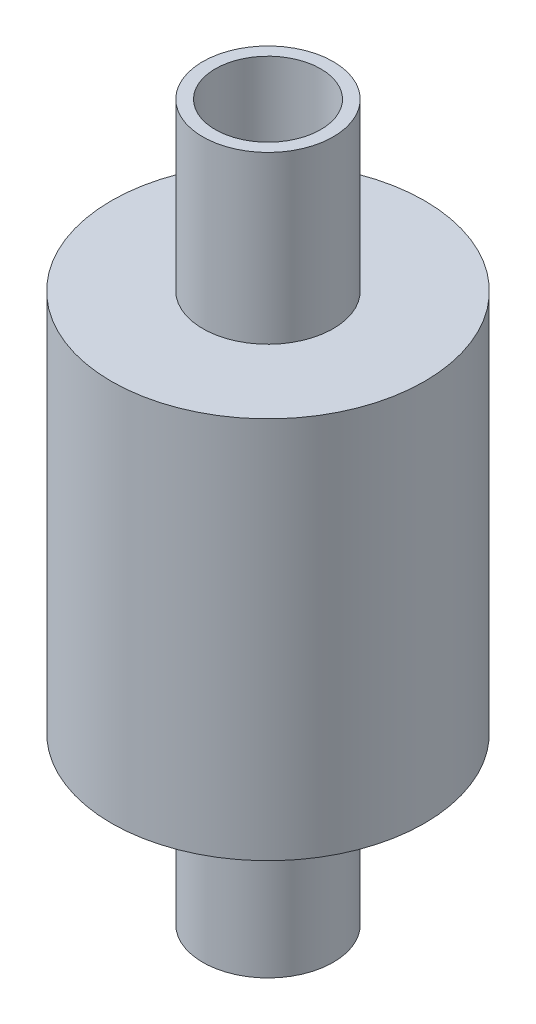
ISO-10303-21;
HEADER;
FILE_DESCRIPTION(('STEP AP214'),'2;1');
FILE_NAME('part.step','',(''),(''),'','','');
FILE_SCHEMA(('AUTOMOTIVE_DESIGN { 1 0 10303 214 1 1 1 1 }'));
ENDSEC;
DATA;
#1=APPLICATION_CONTEXT('core data for automotive mechanical design processes');
#2=APPLICATION_PROTOCOL_DEFINITION('international standard','automotive_design',2000,#1);
#3=PRODUCT_CONTEXT('',#1,'mechanical');
#4=PRODUCT('Part','Part','',(#3));
#5=PRODUCT_RELATED_PRODUCT_CATEGORY('part','',(#4));
#6=PRODUCT_DEFINITION_FORMATION('','',#4);
#7=PRODUCT_DEFINITION_CONTEXT('part definition',#1,'design');
#8=PRODUCT_DEFINITION('design','',#6,#7);
#9=PRODUCT_DEFINITION_SHAPE('','',#8);
#10=(LENGTH_UNIT() NAMED_UNIT(*) SI_UNIT(.MILLI.,.METRE.));
#11=(NAMED_UNIT(*) PLANE_ANGLE_UNIT() SI_UNIT($,.RADIAN.));
#12=(NAMED_UNIT(*) SI_UNIT($,.STERADIAN.) SOLID_ANGLE_UNIT());
#13=UNCERTAINTY_MEASURE_WITH_UNIT(LENGTH_MEASURE(1.E-05),#10,'distance_accuracy_value','');
#14=(GEOMETRIC_REPRESENTATION_CONTEXT(3) GLOBAL_UNCERTAINTY_ASSIGNED_CONTEXT((#13)) GLOBAL_UNIT_ASSIGNED_CONTEXT((#10,
#11,#12)) REPRESENTATION_CONTEXT('',''));
#15=CARTESIAN_POINT('',(0.,0.,0.));
#16=DIRECTION('',(0.,0.,1.));
#17=DIRECTION('',(1.,0.,0.));
#18=AXIS2_PLACEMENT_3D('',#15,#16,#17);
#19=CARTESIAN_POINT('',(-4.7625,0.,0.));
#20=DIRECTION('',(0.,1.,0.));
#21=DIRECTION('',(0.,0.,1.));
#22=AXIS2_PLACEMENT_3D('',#19,#20,#21);
#23=PLANE('',#22);
#24=CARTESIAN_POINT('',(0.,0.,0.));
#25=DIRECTION('',(0.,-1.,0.));
#26=DIRECTION('',(0.,0.,-1.));
#27=AXIS2_PLACEMENT_3D('',#24,#25,#26);
#28=CIRCLE('',#27,3.8481);
#29=CARTESIAN_POINT('',(0.,0.,-3.8481));
#30=VERTEX_POINT('',#29);
#31=EDGE_CURVE('E10',#30,#30,#28,.T.);
#32=ORIENTED_EDGE('',*,*,#31,.F.);
#33=EDGE_LOOP('',(#32));
#34=FACE_BOUND('',#33,.T.);
#35=CARTESIAN_POINT('',(0.,0.,0.));
#36=DIRECTION('',(0.,-1.,0.));
#37=DIRECTION('',(0.,0.,-1.));
#38=AXIS2_PLACEMENT_3D('',#35,#36,#37);
#39=CIRCLE('',#38,4.7625);
#40=CARTESIAN_POINT('',(0.,0.,-4.7625));
#41=VERTEX_POINT('',#40);
#42=EDGE_CURVE('E60',#41,#41,#39,.T.);
#43=ORIENTED_EDGE('',*,*,#42,.T.);
#44=EDGE_LOOP('',(#43));
#45=FACE_BOUND('',#44,.T.);
#46=ADVANCED_FACE('F32',(#34,#45),#23,.F.);
#47=CARTESIAN_POINT('',(0.,0.,0.));
#48=DIRECTION('',(0.,-1.,0.));
#49=DIRECTION('',(0.,0.,-1.));
#50=AXIS2_PLACEMENT_3D('',#47,#48,#49);
#51=CYLINDRICAL_SURFACE('',#50,3.8481);
#52=CARTESIAN_POINT('',(0.,52.197,0.));
#53=DIRECTION('',(0.,-1.,0.));
#54=DIRECTION('',(0.,0.,-1.));
#55=AXIS2_PLACEMENT_3D('',#52,#53,#54);
#56=CIRCLE('',#55,3.8481);
#57=CARTESIAN_POINT('',(0.,52.197,-3.8481));
#58=VERTEX_POINT('',#57);
#59=EDGE_CURVE('E38',#58,#58,#56,.T.);
#60=ORIENTED_EDGE('',*,*,#59,.F.);
#61=EDGE_LOOP('',(#60));
#62=FACE_BOUND('',#61,.T.);
#63=ORIENTED_EDGE('',*,*,#31,.T.);
#64=EDGE_LOOP('',(#63));
#65=FACE_BOUND('',#64,.T.);
#66=ADVANCED_FACE('F97',(#62,#65),#51,.F.);
#67=CARTESIAN_POINT('',(-3.84809999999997,52.197,0.));
#68=DIRECTION('',(0.,-1.,0.));
#69=DIRECTION('',(0.,0.,-1.));
#70=AXIS2_PLACEMENT_3D('',#67,#68,#69);
#71=PLANE('',#70);
#72=CARTESIAN_POINT('',(0.,52.197,0.));
#73=DIRECTION('',(0.,-1.,0.));
#74=DIRECTION('',(0.,0.,-1.));
#75=AXIS2_PLACEMENT_3D('',#72,#73,#74);
#76=CIRCLE('',#75,4.7625);
#77=CARTESIAN_POINT('',(0.,52.197,-4.7625));
#78=VERTEX_POINT('',#77);
#79=EDGE_CURVE('E42',#78,#78,#76,.T.);
#80=ORIENTED_EDGE('',*,*,#79,.F.);
#81=EDGE_LOOP('',(#80));
#82=FACE_BOUND('',#81,.T.);
#83=ORIENTED_EDGE('',*,*,#59,.T.);
#84=EDGE_LOOP('',(#83));
#85=FACE_BOUND('',#84,.T.);
#86=ADVANCED_FACE('F92',(#82,#85),#71,.F.);
#87=CARTESIAN_POINT('',(0.,0.,0.));
#88=DIRECTION('',(0.,-1.,0.));
#89=DIRECTION('',(0.,0.,-1.));
#90=AXIS2_PLACEMENT_3D('',#87,#88,#89);
#91=CYLINDRICAL_SURFACE('',#90,4.7625);
#92=CARTESIAN_POINT('',(0.,40.0685,0.));
#93=DIRECTION('',(0.,-1.,0.));
#94=DIRECTION('',(0.,0.,-1.));
#95=AXIS2_PLACEMENT_3D('',#92,#93,#94);
#96=CIRCLE('',#95,4.7625);
#97=CARTESIAN_POINT('',(0.,40.0685,-4.7625));
#98=VERTEX_POINT('',#97);
#99=EDGE_CURVE('E46',#98,#98,#96,.T.);
#100=ORIENTED_EDGE('',*,*,#99,.F.);
#101=EDGE_LOOP('',(#100));
#102=FACE_BOUND('',#101,.T.);
#103=ORIENTED_EDGE('',*,*,#79,.T.);
#104=EDGE_LOOP('',(#103));
#105=FACE_BOUND('',#104,.T.);
#106=ADVANCED_FACE('F86',(#102,#105),#91,.T.);
#107=CARTESIAN_POINT('',(-4.7625,40.0685,0.));
#108=DIRECTION('',(0.,-1.,0.));
#109=DIRECTION('',(0.,0.,-1.));
#110=AXIS2_PLACEMENT_3D('',#107,#108,#109);
#111=PLANE('',#110);
#112=CARTESIAN_POINT('',(0.,40.0685,0.));
#113=DIRECTION('',(0.,-1.,0.));
#114=DIRECTION('',(0.,0.,-1.));
#115=AXIS2_PLACEMENT_3D('',#112,#113,#114);
#116=CIRCLE('',#115,11.43);
#117=CARTESIAN_POINT('',(0.,40.0685,-11.43));
#118=VERTEX_POINT('',#117);
#119=EDGE_CURVE('E51',#118,#118,#116,.T.);
#120=ORIENTED_EDGE('',*,*,#119,.F.);
#121=EDGE_LOOP('',(#120));
#122=FACE_BOUND('',#121,.T.);
#123=ORIENTED_EDGE('',*,*,#99,.T.);
#124=EDGE_LOOP('',(#123));
#125=FACE_BOUND('',#124,.T.);
#126=ADVANCED_FACE('F80',(#122,#125),#111,.F.);
#127=CARTESIAN_POINT('',(0.,0.,0.));
#128=DIRECTION('',(0.,-1.,0.));
#129=DIRECTION('',(0.,0.,-1.));
#130=AXIS2_PLACEMENT_3D('',#127,#128,#129);
#131=CYLINDRICAL_SURFACE('',#130,11.43);
#132=CARTESIAN_POINT('',(0.,12.1285,0.));
#133=DIRECTION('',(0.,-1.,0.));
#134=DIRECTION('',(0.,0.,-1.));
#135=AXIS2_PLACEMENT_3D('',#132,#133,#134);
#136=CIRCLE('',#135,11.43);
#137=CARTESIAN_POINT('',(0.,12.1285,-11.43));
#138=VERTEX_POINT('',#137);
#139=EDGE_CURVE('E54',#138,#138,#136,.T.);
#140=ORIENTED_EDGE('',*,*,#139,.F.);
#141=EDGE_LOOP('',(#140));
#142=FACE_BOUND('',#141,.T.);
#143=ORIENTED_EDGE('',*,*,#119,.T.);
#144=EDGE_LOOP('',(#143));
#145=FACE_BOUND('',#144,.T.);
#146=ADVANCED_FACE('F74',(#142,#145),#131,.T.);
#147=CARTESIAN_POINT('',(-11.43,12.1285,0.));
#148=DIRECTION('',(0.,1.,0.));
#149=DIRECTION('',(0.,0.,1.));
#150=AXIS2_PLACEMENT_3D('',#147,#148,#149);
#151=PLANE('',#150);
#152=CARTESIAN_POINT('',(0.,12.1285,0.));
#153=DIRECTION('',(0.,-1.,0.));
#154=DIRECTION('',(0.,0.,-1.));
#155=AXIS2_PLACEMENT_3D('',#152,#153,#154);
#156=CIRCLE('',#155,4.7625);
#157=CARTESIAN_POINT('',(0.,12.1285,-4.7625));
#158=VERTEX_POINT('',#157);
#159=EDGE_CURVE('E57',#158,#158,#156,.T.);
#160=ORIENTED_EDGE('',*,*,#159,.F.);
#161=EDGE_LOOP('',(#160));
#162=FACE_BOUND('',#161,.T.);
#163=ORIENTED_EDGE('',*,*,#139,.T.);
#164=EDGE_LOOP('',(#163));
#165=FACE_BOUND('',#164,.T.);
#166=ADVANCED_FACE('F68',(#162,#165),#151,.F.);
#167=CARTESIAN_POINT('',(0.,0.,0.));
#168=DIRECTION('',(0.,-1.,0.));
#169=DIRECTION('',(0.,0.,-1.));
#170=AXIS2_PLACEMENT_3D('',#167,#168,#169);
#171=CYLINDRICAL_SURFACE('',#170,4.7625);
#172=ORIENTED_EDGE('',*,*,#42,.F.);
#173=EDGE_LOOP('',(#172));
#174=FACE_BOUND('',#173,.T.);
#175=ORIENTED_EDGE('',*,*,#159,.T.);
#176=EDGE_LOOP('',(#175));
#177=FACE_BOUND('',#176,.T.);
#178=ADVANCED_FACE('F65',(#174,#177),#171,.T.);
#179=CLOSED_SHELL('',(#46,#66,#86,#106,#126,#146,#166,#178));
#180=MANIFOLD_SOLID_BREP('B2',#179);
#181=ADVANCED_BREP_SHAPE_REPRESENTATION('',(#18,#180),#14);
#182=SHAPE_DEFINITION_REPRESENTATION(#9,#181);
ENDSEC;
END-ISO-10303-21;
